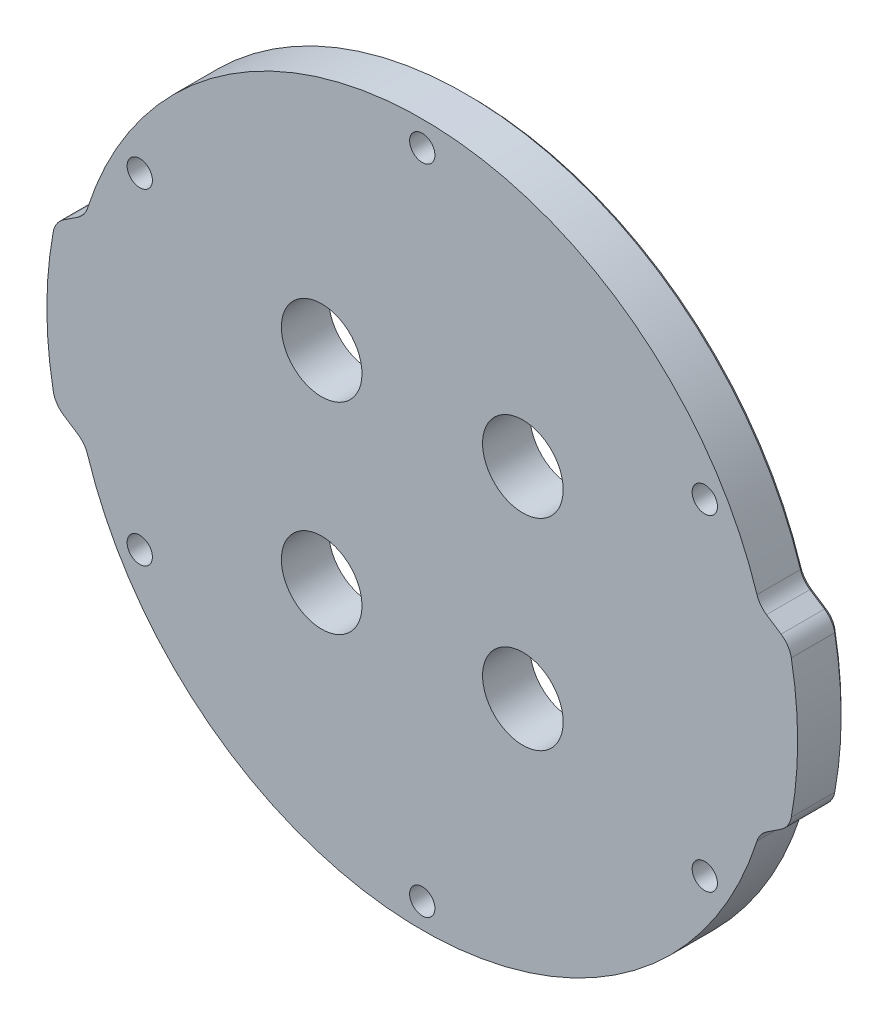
ISO-10303-21;
HEADER;
FILE_DESCRIPTION(('STEP AP214'),'2;1');
FILE_NAME('part.step','',(''),(''),'','','');
FILE_SCHEMA(('AUTOMOTIVE_DESIGN { 1 0 10303 214 1 1 1 1 }'));
ENDSEC;
DATA;
#1=APPLICATION_CONTEXT('core data for automotive mechanical design processes');
#2=APPLICATION_PROTOCOL_DEFINITION('international standard','automotive_design',2000,#1);
#3=PRODUCT_CONTEXT('',#1,'mechanical');
#4=PRODUCT('Part','Part','',(#3));
#5=PRODUCT_RELATED_PRODUCT_CATEGORY('part','',(#4));
#6=PRODUCT_DEFINITION_FORMATION('','',#4);
#7=PRODUCT_DEFINITION_CONTEXT('part definition',#1,'design');
#8=PRODUCT_DEFINITION('design','',#6,#7);
#9=PRODUCT_DEFINITION_SHAPE('','',#8);
#10=(LENGTH_UNIT() NAMED_UNIT(*) SI_UNIT(.MILLI.,.METRE.));
#11=(NAMED_UNIT(*) PLANE_ANGLE_UNIT() SI_UNIT($,.RADIAN.));
#12=(NAMED_UNIT(*) SI_UNIT($,.STERADIAN.) SOLID_ANGLE_UNIT());
#13=UNCERTAINTY_MEASURE_WITH_UNIT(LENGTH_MEASURE(1.E-05),#10,'distance_accuracy_value','');
#14=(GEOMETRIC_REPRESENTATION_CONTEXT(3) GLOBAL_UNCERTAINTY_ASSIGNED_CONTEXT((#13)) GLOBAL_UNIT_ASSIGNED_CONTEXT((#10,
#11,#12)) REPRESENTATION_CONTEXT('',''));
#15=CARTESIAN_POINT('',(0.,0.,0.));
#16=DIRECTION('',(0.,0.,1.));
#17=DIRECTION('',(1.,0.,0.));
#18=AXIS2_PLACEMENT_3D('',#15,#16,#17);
#19=CARTESIAN_POINT('',(0.,0.,6.));
#20=DIRECTION('',(0.,0.,-1.));
#21=DIRECTION('',(-1.,0.,0.));
#22=AXIS2_PLACEMENT_3D('',#19,#20,#21);
#23=PLANE('',#22);
#24=CARTESIAN_POINT('',(-12.7279220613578,12.7279220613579,6.));
#25=DIRECTION('',(0.,0.,1.));
#26=DIRECTION('',(1.,0.,0.));
#27=AXIS2_PLACEMENT_3D('',#24,#25,#26);
#28=CIRCLE('',#27,5.1);
#29=CARTESIAN_POINT('',(-7.62792206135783,12.7279220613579,6.));
#30=VERTEX_POINT('',#29);
#31=EDGE_CURVE('E462',#30,#30,#28,.T.);
#32=ORIENTED_EDGE('',*,*,#31,.F.);
#33=EDGE_LOOP('',(#32));
#34=FACE_BOUND('',#33,.T.);
#35=CARTESIAN_POINT('',(-12.7279220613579,-12.7279220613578,6.));
#36=DIRECTION('',(0.,0.,1.));
#37=DIRECTION('',(1.,0.,0.));
#38=AXIS2_PLACEMENT_3D('',#35,#36,#37);
#39=CIRCLE('',#38,5.1);
#40=CARTESIAN_POINT('',(-7.62792206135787,-12.7279220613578,6.));
#41=VERTEX_POINT('',#40);
#42=EDGE_CURVE('E477',#41,#41,#39,.T.);
#43=ORIENTED_EDGE('',*,*,#42,.F.);
#44=EDGE_LOOP('',(#43));
#45=FACE_BOUND('',#44,.T.);
#46=CARTESIAN_POINT('',(12.7279220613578,-12.7279220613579,6.));
#47=DIRECTION('',(0.,0.,1.));
#48=DIRECTION('',(1.,0.,0.));
#49=AXIS2_PLACEMENT_3D('',#46,#47,#48);
#50=CIRCLE('',#49,5.1);
#51=CARTESIAN_POINT('',(17.8279220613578,-12.7279220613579,6.));
#52=VERTEX_POINT('',#51);
#53=EDGE_CURVE('E484',#52,#52,#50,.T.);
#54=ORIENTED_EDGE('',*,*,#53,.F.);
#55=EDGE_LOOP('',(#54));
#56=FACE_BOUND('',#55,.T.);
#57=CARTESIAN_POINT('',(12.7279220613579,12.7279220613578,6.));
#58=DIRECTION('',(0.,0.,1.));
#59=DIRECTION('',(1.,0.,0.));
#60=AXIS2_PLACEMENT_3D('',#57,#58,#59);
#61=CIRCLE('',#60,5.10000000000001);
#62=CARTESIAN_POINT('',(17.8279220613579,12.7279220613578,6.));
#63=VERTEX_POINT('',#62);
#64=EDGE_CURVE('E491',#63,#63,#61,.T.);
#65=ORIENTED_EDGE('',*,*,#64,.F.);
#66=EDGE_LOOP('',(#65));
#67=FACE_BOUND('',#66,.T.);
#68=DIRECTION('',(0.834029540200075,0.551719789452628,0.));
#69=VECTOR('',#68,1.);
#70=CARTESIAN_POINT('',(46.4354390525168,-10.,6.));
#71=LINE('',#70,#69);
#72=CARTESIAN_POINT('',(43.5545381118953,-11.9057479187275,6.));
#73=VERTEX_POINT('',#72);
#74=CARTESIAN_POINT('',(45.3958207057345,-10.687719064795,6.));
#75=VERTEX_POINT('',#74);
#76=EDGE_CURVE('E212',#73,#75,#71,.T.);
#77=ORIENTED_EDGE('',*,*,#76,.T.);
#78=CARTESIAN_POINT('',(43.7406613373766,-8.18563044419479,6.));
#79=DIRECTION('',(0.,0.,-1.));
#80=DIRECTION('',(-1.,0.,0.));
#81=AXIS2_PLACEMENT_3D('',#78,#79,#80);
#82=CIRCLE('',#81,3.);
#83=CARTESIAN_POINT('',(46.6894699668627,-8.73747069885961,6.));
#84=VERTEX_POINT('',#83);
#85=EDGE_CURVE('E206',#75,#84,#82,.F.);
#86=ORIENTED_EDGE('',*,*,#85,.T.);
#87=CARTESIAN_POINT('',(0.,0.,6.));
#88=DIRECTION('',(0.,0.,1.));
#89=DIRECTION('',(-1.,0.,0.));
#90=AXIS2_PLACEMENT_3D('',#87,#88,#89);
#91=CIRCLE('',#90,47.5);
#92=CARTESIAN_POINT('',(46.6894699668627,8.73747069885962,6.));
#93=VERTEX_POINT('',#92);
#94=EDGE_CURVE('E209',#84,#93,#91,.T.);
#95=ORIENTED_EDGE('',*,*,#94,.T.);
#96=CARTESIAN_POINT('',(43.7406613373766,8.1856304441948,6.));
#97=DIRECTION('',(0.,0.,-1.));
#98=DIRECTION('',(-1.,0.,0.));
#99=AXIS2_PLACEMENT_3D('',#96,#97,#98);
#100=CIRCLE('',#99,3.);
#101=CARTESIAN_POINT('',(45.3958207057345,10.687719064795,6.));
#102=VERTEX_POINT('',#101);
#103=EDGE_CURVE('E218',#93,#102,#100,.F.);
#104=ORIENTED_EDGE('',*,*,#103,.T.);
#105=DIRECTION('',(-0.834029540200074,0.551719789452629,0.));
#106=VECTOR('',#105,1.);
#107=CARTESIAN_POINT('',(46.4354390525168,10.,6.));
#108=LINE('',#107,#106);
#109=CARTESIAN_POINT('',(43.5545381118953,11.9057479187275,6.));
#110=VERTEX_POINT('',#109);
#111=EDGE_CURVE('E228',#102,#110,#108,.T.);
#112=ORIENTED_EDGE('',*,*,#111,.T.);
#113=CARTESIAN_POINT('',(45.2096974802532,14.4078365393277,6.));
#114=DIRECTION('',(0.,0.,-1.));
#115=DIRECTION('',(-1.,0.,0.));
#116=AXIS2_PLACEMENT_3D('',#113,#114,#115);
#117=CIRCLE('',#116,3.);
#118=CARTESIAN_POINT('',(42.3513393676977,13.4969090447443,6.));
#119=VERTEX_POINT('',#118);
#120=EDGE_CURVE('E297',#110,#119,#117,.T.);
#121=ORIENTED_EDGE('',*,*,#120,.T.);
#122=CARTESIAN_POINT('',(0.,0.,6.));
#123=DIRECTION('',(0.,0.,1.));
#124=DIRECTION('',(1.,0.,0.));
#125=AXIS2_PLACEMENT_3D('',#122,#123,#124);
#126=CIRCLE('',#125,44.45);
#127=CARTESIAN_POINT('',(-42.3513393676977,13.4969090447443,6.));
#128=VERTEX_POINT('',#127);
#129=EDGE_CURVE('E551',#119,#128,#126,.T.);
#130=ORIENTED_EDGE('',*,*,#129,.T.);
#131=CARTESIAN_POINT('',(-45.2096974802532,14.4078365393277,6.));
#132=DIRECTION('',(0.,0.,-1.));
#133=DIRECTION('',(-1.,0.,0.));
#134=AXIS2_PLACEMENT_3D('',#131,#132,#133);
#135=CIRCLE('',#134,3.);
#136=CARTESIAN_POINT('',(-43.5545381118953,11.9057479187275,6.));
#137=VERTEX_POINT('',#136);
#138=EDGE_CURVE('E306',#128,#137,#135,.T.);
#139=ORIENTED_EDGE('',*,*,#138,.T.);
#140=DIRECTION('',(-0.834029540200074,-0.551719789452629,0.));
#141=VECTOR('',#140,1.);
#142=CARTESIAN_POINT('',(-46.4354390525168,10.,6.));
#143=LINE('',#142,#141);
#144=CARTESIAN_POINT('',(-45.3958207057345,10.687719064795,6.));
#145=VERTEX_POINT('',#144);
#146=EDGE_CURVE('E555',#137,#145,#143,.T.);
#147=ORIENTED_EDGE('',*,*,#146,.T.);
#148=CARTESIAN_POINT('',(-43.7406613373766,8.1856304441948,6.));
#149=DIRECTION('',(0.,0.,-1.));
#150=DIRECTION('',(-1.,0.,0.));
#151=AXIS2_PLACEMENT_3D('',#148,#149,#150);
#152=CIRCLE('',#151,3.);
#153=CARTESIAN_POINT('',(-46.6894699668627,8.73747069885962,6.));
#154=VERTEX_POINT('',#153);
#155=EDGE_CURVE('E249',#145,#154,#152,.F.);
#156=ORIENTED_EDGE('',*,*,#155,.T.);
#157=CARTESIAN_POINT('',(0.,0.,6.));
#158=DIRECTION('',(0.,0.,1.));
#159=DIRECTION('',(1.,0.,0.));
#160=AXIS2_PLACEMENT_3D('',#157,#158,#159);
#161=CIRCLE('',#160,47.5);
#162=CARTESIAN_POINT('',(-46.6894699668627,-8.73747069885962,6.));
#163=VERTEX_POINT('',#162);
#164=EDGE_CURVE('E559',#154,#163,#161,.T.);
#165=ORIENTED_EDGE('',*,*,#164,.T.);
#166=CARTESIAN_POINT('',(-43.7406613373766,-8.1856304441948,6.));
#167=DIRECTION('',(0.,0.,-1.));
#168=DIRECTION('',(-1.,0.,0.));
#169=AXIS2_PLACEMENT_3D('',#166,#167,#168);
#170=CIRCLE('',#169,3.);
#171=CARTESIAN_POINT('',(-45.3958207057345,-10.687719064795,6.));
#172=VERTEX_POINT('',#171);
#173=EDGE_CURVE('E252',#163,#172,#170,.F.);
#174=ORIENTED_EDGE('',*,*,#173,.T.);
#175=DIRECTION('',(0.834029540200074,-0.551719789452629,0.));
#176=VECTOR('',#175,1.);
#177=CARTESIAN_POINT('',(-46.4354390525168,-10.,6.));
#178=LINE('',#177,#176);
#179=CARTESIAN_POINT('',(-43.5545381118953,-11.9057479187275,6.));
#180=VERTEX_POINT('',#179);
#181=EDGE_CURVE('E563',#172,#180,#178,.T.);
#182=ORIENTED_EDGE('',*,*,#181,.T.);
#183=CARTESIAN_POINT('',(-45.2096974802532,-14.4078365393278,6.));
#184=DIRECTION('',(0.,0.,-1.));
#185=DIRECTION('',(-1.,0.,0.));
#186=AXIS2_PLACEMENT_3D('',#183,#184,#185);
#187=CIRCLE('',#186,3.);
#188=CARTESIAN_POINT('',(-42.3513393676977,-13.4969090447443,6.));
#189=VERTEX_POINT('',#188);
#190=EDGE_CURVE('E303',#180,#189,#187,.T.);
#191=ORIENTED_EDGE('',*,*,#190,.T.);
#192=CARTESIAN_POINT('',(0.,0.,6.));
#193=DIRECTION('',(0.,0.,1.));
#194=DIRECTION('',(1.,0.,0.));
#195=AXIS2_PLACEMENT_3D('',#192,#193,#194);
#196=CIRCLE('',#195,44.45);
#197=CARTESIAN_POINT('',(42.3513393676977,-13.4969090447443,6.));
#198=VERTEX_POINT('',#197);
#199=EDGE_CURVE('E566',#189,#198,#196,.T.);
#200=ORIENTED_EDGE('',*,*,#199,.T.);
#201=CARTESIAN_POINT('',(45.2096974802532,-14.4078365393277,6.));
#202=DIRECTION('',(0.,0.,-1.));
#203=DIRECTION('',(-1.,0.,0.));
#204=AXIS2_PLACEMENT_3D('',#201,#202,#203);
#205=CIRCLE('',#204,3.);
#206=EDGE_CURVE('E300',#198,#73,#205,.T.);
#207=ORIENTED_EDGE('',*,*,#206,.T.);
#208=EDGE_LOOP('',(#77,#86,#95,#104,#112,#121,#130,#139,#147,#156,#165,#174,#182,#191,#200,#207));
#209=FACE_BOUND('',#208,.T.);
#210=CARTESIAN_POINT('',(0.,41.275,6.));
#211=DIRECTION('',(0.,0.,1.));
#212=DIRECTION('',(1.,0.,0.));
#213=AXIS2_PLACEMENT_3D('',#210,#211,#212);
#214=CIRCLE('',#213,1.6);
#215=CARTESIAN_POINT('',(1.6,41.275,6.));
#216=VERTEX_POINT('',#215);
#217=EDGE_CURVE('E229',#216,#216,#214,.T.);
#218=ORIENTED_EDGE('',*,*,#217,.F.);
#219=EDGE_LOOP('',(#218));
#220=FACE_BOUND('',#219,.T.);
#221=CARTESIAN_POINT('',(-35.7451985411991,-20.6375000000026,6.));
#222=DIRECTION('',(0.,0.,1.));
#223=DIRECTION('',(1.,0.,0.));
#224=AXIS2_PLACEMENT_3D('',#221,#222,#223);
#225=CIRCLE('',#224,1.6);
#226=CARTESIAN_POINT('',(-34.1451985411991,-20.6375000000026,6.));
#227=VERTEX_POINT('',#226);
#228=EDGE_CURVE('E534',#227,#227,#225,.T.);
#229=ORIENTED_EDGE('',*,*,#228,.F.);
#230=EDGE_LOOP('',(#229));
#231=FACE_BOUND('',#230,.T.);
#232=CARTESIAN_POINT('',(35.7451985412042,20.6375000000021,6.));
#233=DIRECTION('',(0.,0.,1.));
#234=DIRECTION('',(1.,0.,0.));
#235=AXIS2_PLACEMENT_3D('',#232,#233,#234);
#236=CIRCLE('',#235,1.59999999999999);
#237=CARTESIAN_POINT('',(37.3451985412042,20.6375000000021,6.));
#238=VERTEX_POINT('',#237);
#239=EDGE_CURVE('E526',#238,#238,#236,.T.);
#240=ORIENTED_EDGE('',*,*,#239,.F.);
#241=EDGE_LOOP('',(#240));
#242=FACE_BOUND('',#241,.T.);
#243=CARTESIAN_POINT('',(35.7451985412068,-20.6374999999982,6.));
#244=DIRECTION('',(0.,0.,1.));
#245=DIRECTION('',(1.,0.,0.));
#246=AXIS2_PLACEMENT_3D('',#243,#244,#245);
#247=CIRCLE('',#246,1.6);
#248=CARTESIAN_POINT('',(37.3451985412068,-20.6374999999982,6.));
#249=VERTEX_POINT('',#248);
#250=EDGE_CURVE('E518',#249,#249,#247,.T.);
#251=ORIENTED_EDGE('',*,*,#250,.F.);
#252=EDGE_LOOP('',(#251));
#253=FACE_BOUND('',#252,.T.);
#254=CARTESIAN_POINT('',(5.11138805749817E-12,-41.2750000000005,6.));
#255=DIRECTION('',(0.,0.,1.));
#256=DIRECTION('',(1.,0.,0.));
#257=AXIS2_PLACEMENT_3D('',#254,#255,#256);
#258=CIRCLE('',#257,1.6);
#259=CARTESIAN_POINT('',(1.60000000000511,-41.2750000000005,6.));
#260=VERTEX_POINT('',#259);
#261=EDGE_CURVE('E510',#260,#260,#258,.T.);
#262=ORIENTED_EDGE('',*,*,#261,.F.);
#263=EDGE_LOOP('',(#262));
#264=FACE_BOUND('',#263,.T.);
#265=CARTESIAN_POINT('',(-35.7451985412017,20.6374999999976,6.));
#266=DIRECTION('',(0.,0.,1.));
#267=DIRECTION('',(1.,0.,0.));
#268=AXIS2_PLACEMENT_3D('',#265,#266,#267);
#269=CIRCLE('',#268,1.6);
#270=CARTESIAN_POINT('',(-34.1451985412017,20.6374999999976,6.));
#271=VERTEX_POINT('',#270);
#272=EDGE_CURVE('E503',#271,#271,#269,.T.);
#273=ORIENTED_EDGE('',*,*,#272,.F.);
#274=EDGE_LOOP('',(#273));
#275=FACE_BOUND('',#274,.T.);
#276=ADVANCED_FACE('F41',(#34,#45,#56,#67,#209,#220,#231,#242,#253,#264,#275),#23,.F.);
#277=CARTESIAN_POINT('',(0.,0.,0.));
#278=DIRECTION('',(0.,0.,-1.));
#279=DIRECTION('',(-1.,0.,0.));
#280=AXIS2_PLACEMENT_3D('',#277,#278,#279);
#281=PLANE('',#280);
#282=CARTESIAN_POINT('',(45.2096974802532,-14.4078365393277,0.));
#283=DIRECTION('',(0.,0.,-1.));
#284=DIRECTION('',(-1.,0.,0.));
#285=AXIS2_PLACEMENT_3D('',#282,#283,#284);
#286=CIRCLE('',#285,3.5);
#287=CARTESIAN_POINT('',(43.278678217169,-11.4887331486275,0.));
#288=VERTEX_POINT('',#287);
#289=CARTESIAN_POINT('',(41.8749463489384,-13.3450877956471,0.));
#290=VERTEX_POINT('',#289);
#291=EDGE_CURVE('E354',#288,#290,#286,.F.);
#292=ORIENTED_EDGE('',*,*,#291,.T.);
#293=CARTESIAN_POINT('',(0.,0.,0.));
#294=DIRECTION('',(0.,0.,-1.));
#295=DIRECTION('',(-1.,0.,0.));
#296=AXIS2_PLACEMENT_3D('',#293,#294,#295);
#297=CIRCLE('',#296,43.95);
#298=CARTESIAN_POINT('',(-41.8749463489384,-13.3450877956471,0.));
#299=VERTEX_POINT('',#298);
#300=EDGE_CURVE('E357',#290,#299,#297,.T.);
#301=ORIENTED_EDGE('',*,*,#300,.T.);
#302=CARTESIAN_POINT('',(-45.2096974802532,-14.4078365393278,0.));
#303=DIRECTION('',(0.,0.,-1.));
#304=DIRECTION('',(-1.,0.,0.));
#305=AXIS2_PLACEMENT_3D('',#302,#303,#304);
#306=CIRCLE('',#305,3.5);
#307=CARTESIAN_POINT('',(-43.278678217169,-11.4887331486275,0.));
#308=VERTEX_POINT('',#307);
#309=EDGE_CURVE('E351',#299,#308,#306,.F.);
#310=ORIENTED_EDGE('',*,*,#309,.T.);
#311=DIRECTION('',(-0.834029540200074,0.551719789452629,0.));
#312=VECTOR('',#311,1.);
#313=CARTESIAN_POINT('',(-45.1199608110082,-10.270704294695,0.));
#314=LINE('',#313,#312);
#315=CARTESIAN_POINT('',(-45.1199608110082,-10.270704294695,0.));
#316=VERTEX_POINT('',#315);
#317=EDGE_CURVE('E345',#308,#316,#314,.T.);
#318=ORIENTED_EDGE('',*,*,#317,.T.);
#319=CARTESIAN_POINT('',(-43.7406613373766,-8.1856304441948,0.));
#320=DIRECTION('',(0.,0.,-1.));
#321=DIRECTION('',(-1.,0.,0.));
#322=AXIS2_PLACEMENT_3D('',#319,#320,#321);
#323=CIRCLE('',#322,2.5);
#324=CARTESIAN_POINT('',(-46.1980018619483,-8.64549732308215,0.));
#325=VERTEX_POINT('',#324);
#326=EDGE_CURVE('E339',#316,#325,#323,.T.);
#327=ORIENTED_EDGE('',*,*,#326,.T.);
#328=CARTESIAN_POINT('',(0.,0.,0.));
#329=DIRECTION('',(0.,0.,-1.));
#330=DIRECTION('',(-1.,0.,0.));
#331=AXIS2_PLACEMENT_3D('',#328,#329,#330);
#332=CIRCLE('',#331,47.);
#333=CARTESIAN_POINT('',(-46.1980018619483,8.64549732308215,0.));
#334=VERTEX_POINT('',#333);
#335=EDGE_CURVE('E333',#325,#334,#332,.T.);
#336=ORIENTED_EDGE('',*,*,#335,.T.);
#337=CARTESIAN_POINT('',(-43.7406613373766,8.1856304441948,0.));
#338=DIRECTION('',(0.,0.,-1.));
#339=DIRECTION('',(-1.,0.,0.));
#340=AXIS2_PLACEMENT_3D('',#337,#338,#339);
#341=CIRCLE('',#340,2.5);
#342=CARTESIAN_POINT('',(-45.1199608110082,10.270704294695,0.));
#343=VERTEX_POINT('',#342);
#344=EDGE_CURVE('E327',#334,#343,#341,.T.);
#345=ORIENTED_EDGE('',*,*,#344,.T.);
#346=DIRECTION('',(0.834029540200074,0.551719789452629,0.));
#347=VECTOR('',#346,1.);
#348=CARTESIAN_POINT('',(-43.278678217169,11.4887331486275,0.));
#349=LINE('',#348,#347);
#350=CARTESIAN_POINT('',(-43.278678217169,11.4887331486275,0.));
#351=VERTEX_POINT('',#350);
#352=EDGE_CURVE('E321',#343,#351,#349,.T.);
#353=ORIENTED_EDGE('',*,*,#352,.T.);
#354=CARTESIAN_POINT('',(-45.2096974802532,14.4078365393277,0.));
#355=DIRECTION('',(0.,0.,-1.));
#356=DIRECTION('',(-1.,0.,0.));
#357=AXIS2_PLACEMENT_3D('',#354,#355,#356);
#358=CIRCLE('',#357,3.5);
#359=CARTESIAN_POINT('',(-41.8749463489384,13.3450877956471,0.));
#360=VERTEX_POINT('',#359);
#361=EDGE_CURVE('E315',#351,#360,#358,.F.);
#362=ORIENTED_EDGE('',*,*,#361,.T.);
#363=CARTESIAN_POINT('',(0.,0.,0.));
#364=DIRECTION('',(0.,0.,-1.));
#365=DIRECTION('',(-1.,0.,0.));
#366=AXIS2_PLACEMENT_3D('',#363,#364,#365);
#367=CIRCLE('',#366,43.95);
#368=CARTESIAN_POINT('',(41.8749463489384,13.3450877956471,0.));
#369=VERTEX_POINT('',#368);
#370=EDGE_CURVE('E312',#360,#369,#367,.T.);
#371=ORIENTED_EDGE('',*,*,#370,.T.);
#372=CARTESIAN_POINT('',(45.2096974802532,14.4078365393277,0.));
#373=DIRECTION('',(0.,0.,-1.));
#374=DIRECTION('',(-1.,0.,0.));
#375=AXIS2_PLACEMENT_3D('',#372,#373,#374);
#376=CIRCLE('',#375,3.5);
#377=CARTESIAN_POINT('',(43.278678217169,11.4887331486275,0.));
#378=VERTEX_POINT('',#377);
#379=EDGE_CURVE('E318',#369,#378,#376,.F.);
#380=ORIENTED_EDGE('',*,*,#379,.T.);
#381=DIRECTION('',(0.834029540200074,-0.551719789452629,0.));
#382=VECTOR('',#381,1.);
#383=CARTESIAN_POINT('',(45.1199608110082,10.270704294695,0.));
#384=LINE('',#383,#382);
#385=CARTESIAN_POINT('',(45.1199608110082,10.270704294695,0.));
#386=VERTEX_POINT('',#385);
#387=EDGE_CURVE('E324',#378,#386,#384,.T.);
#388=ORIENTED_EDGE('',*,*,#387,.T.);
#389=CARTESIAN_POINT('',(43.7406613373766,8.1856304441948,0.));
#390=DIRECTION('',(0.,0.,-1.));
#391=DIRECTION('',(-1.,0.,0.));
#392=AXIS2_PLACEMENT_3D('',#389,#390,#391);
#393=CIRCLE('',#392,2.5);
#394=CARTESIAN_POINT('',(46.1980018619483,8.64549732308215,0.));
#395=VERTEX_POINT('',#394);
#396=EDGE_CURVE('E330',#386,#395,#393,.T.);
#397=ORIENTED_EDGE('',*,*,#396,.T.);
#398=CARTESIAN_POINT('',(0.,0.,0.));
#399=DIRECTION('',(0.,0.,-1.));
#400=DIRECTION('',(-1.,0.,0.));
#401=AXIS2_PLACEMENT_3D('',#398,#399,#400);
#402=CIRCLE('',#401,47.);
#403=CARTESIAN_POINT('',(46.1980018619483,-8.64549732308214,0.));
#404=VERTEX_POINT('',#403);
#405=EDGE_CURVE('E336',#395,#404,#402,.T.);
#406=ORIENTED_EDGE('',*,*,#405,.T.);
#407=CARTESIAN_POINT('',(43.7406613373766,-8.18563044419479,0.));
#408=DIRECTION('',(0.,0.,-1.));
#409=DIRECTION('',(-1.,0.,0.));
#410=AXIS2_PLACEMENT_3D('',#407,#408,#409);
#411=CIRCLE('',#410,2.5);
#412=CARTESIAN_POINT('',(45.1199608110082,-10.270704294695,0.));
#413=VERTEX_POINT('',#412);
#414=EDGE_CURVE('E342',#404,#413,#411,.T.);
#415=ORIENTED_EDGE('',*,*,#414,.T.);
#416=DIRECTION('',(-0.834029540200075,-0.551719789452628,0.));
#417=VECTOR('',#416,1.);
#418=CARTESIAN_POINT('',(43.278678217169,-11.4887331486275,0.));
#419=LINE('',#418,#417);
#420=EDGE_CURVE('E348',#413,#288,#419,.T.);
#421=ORIENTED_EDGE('',*,*,#420,.T.);
#422=EDGE_LOOP('',(#292,#301,#310,#318,#327,#336,#345,#353,#362,#371,#380,#388,#397,#406,#415,#421));
#423=FACE_BOUND('',#422,.T.);
#424=CARTESIAN_POINT('',(-12.7279220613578,12.7279220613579,0.));
#425=DIRECTION('',(0.,0.,1.));
#426=DIRECTION('',(1.,0.,0.));
#427=AXIS2_PLACEMENT_3D('',#424,#425,#426);
#428=CIRCLE('',#427,5.1);
#429=CARTESIAN_POINT('',(-7.62792206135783,12.7279220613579,0.));
#430=VERTEX_POINT('',#429);
#431=EDGE_CURVE('E470',#430,#430,#428,.T.);
#432=ORIENTED_EDGE('',*,*,#431,.T.);
#433=EDGE_LOOP('',(#432));
#434=FACE_BOUND('',#433,.T.);
#435=CARTESIAN_POINT('',(-12.7279220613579,-12.7279220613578,0.));
#436=DIRECTION('',(0.,0.,1.));
#437=DIRECTION('',(1.,0.,0.));
#438=AXIS2_PLACEMENT_3D('',#435,#436,#437);
#439=CIRCLE('',#438,5.1);
#440=CARTESIAN_POINT('',(-7.62792206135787,-12.7279220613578,0.));
#441=VERTEX_POINT('',#440);
#442=EDGE_CURVE('E480',#441,#441,#439,.T.);
#443=ORIENTED_EDGE('',*,*,#442,.T.);
#444=EDGE_LOOP('',(#443));
#445=FACE_BOUND('',#444,.T.);
#446=CARTESIAN_POINT('',(12.7279220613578,-12.7279220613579,0.));
#447=DIRECTION('',(0.,0.,1.));
#448=DIRECTION('',(1.,0.,0.));
#449=AXIS2_PLACEMENT_3D('',#446,#447,#448);
#450=CIRCLE('',#449,5.1);
#451=CARTESIAN_POINT('',(17.8279220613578,-12.7279220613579,0.));
#452=VERTEX_POINT('',#451);
#453=EDGE_CURVE('E488',#452,#452,#450,.T.);
#454=ORIENTED_EDGE('',*,*,#453,.T.);
#455=EDGE_LOOP('',(#454));
#456=FACE_BOUND('',#455,.T.);
#457=CARTESIAN_POINT('',(12.7279220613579,12.7279220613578,0.));
#458=DIRECTION('',(0.,0.,1.));
#459=DIRECTION('',(1.,0.,0.));
#460=AXIS2_PLACEMENT_3D('',#457,#458,#459);
#461=CIRCLE('',#460,5.10000000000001);
#462=CARTESIAN_POINT('',(17.8279220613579,12.7279220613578,0.));
#463=VERTEX_POINT('',#462);
#464=EDGE_CURVE('E495',#463,#463,#461,.T.);
#465=ORIENTED_EDGE('',*,*,#464,.T.);
#466=EDGE_LOOP('',(#465));
#467=FACE_BOUND('',#466,.T.);
#468=CARTESIAN_POINT('',(5.11138805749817E-12,-41.2750000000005,0.));
#469=DIRECTION('',(0.,0.,1.));
#470=DIRECTION('',(1.,0.,0.));
#471=AXIS2_PLACEMENT_3D('',#468,#469,#470);
#472=CIRCLE('',#471,1.6);
#473=CARTESIAN_POINT('',(1.60000000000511,-41.2750000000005,0.));
#474=VERTEX_POINT('',#473);
#475=EDGE_CURVE('E507',#474,#474,#472,.T.);
#476=ORIENTED_EDGE('',*,*,#475,.T.);
#477=EDGE_LOOP('',(#476));
#478=FACE_BOUND('',#477,.T.);
#479=CARTESIAN_POINT('',(35.7451985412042,20.6375000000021,0.));
#480=DIRECTION('',(0.,0.,1.));
#481=DIRECTION('',(1.,0.,0.));
#482=AXIS2_PLACEMENT_3D('',#479,#480,#481);
#483=CIRCLE('',#482,1.59999999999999);
#484=CARTESIAN_POINT('',(37.3451985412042,20.6375000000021,0.));
#485=VERTEX_POINT('',#484);
#486=EDGE_CURVE('E522',#485,#485,#483,.T.);
#487=ORIENTED_EDGE('',*,*,#486,.T.);
#488=EDGE_LOOP('',(#487));
#489=FACE_BOUND('',#488,.T.);
#490=CARTESIAN_POINT('',(0.,41.275,0.));
#491=DIRECTION('',(0.,0.,1.));
#492=DIRECTION('',(1.,0.,0.));
#493=AXIS2_PLACEMENT_3D('',#490,#491,#492);
#494=CIRCLE('',#493,1.6);
#495=CARTESIAN_POINT('',(1.6,41.275,0.));
#496=VERTEX_POINT('',#495);
#497=EDGE_CURVE('E538',#496,#496,#494,.T.);
#498=ORIENTED_EDGE('',*,*,#497,.T.);
#499=EDGE_LOOP('',(#498));
#500=FACE_BOUND('',#499,.T.);
#501=CARTESIAN_POINT('',(-35.7451985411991,-20.6375000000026,0.));
#502=DIRECTION('',(0.,0.,1.));
#503=DIRECTION('',(1.,0.,0.));
#504=AXIS2_PLACEMENT_3D('',#501,#502,#503);
#505=CIRCLE('',#504,1.6);
#506=CARTESIAN_POINT('',(-34.1451985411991,-20.6375000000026,0.));
#507=VERTEX_POINT('',#506);
#508=EDGE_CURVE('E530',#507,#507,#505,.T.);
#509=ORIENTED_EDGE('',*,*,#508,.T.);
#510=EDGE_LOOP('',(#509));
#511=FACE_BOUND('',#510,.T.);
#512=CARTESIAN_POINT('',(35.7451985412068,-20.6374999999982,0.));
#513=DIRECTION('',(0.,0.,1.));
#514=DIRECTION('',(1.,0.,0.));
#515=AXIS2_PLACEMENT_3D('',#512,#513,#514);
#516=CIRCLE('',#515,1.6);
#517=CARTESIAN_POINT('',(37.3451985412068,-20.6374999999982,0.));
#518=VERTEX_POINT('',#517);
#519=EDGE_CURVE('E514',#518,#518,#516,.T.);
#520=ORIENTED_EDGE('',*,*,#519,.T.);
#521=EDGE_LOOP('',(#520));
#522=FACE_BOUND('',#521,.T.);
#523=CARTESIAN_POINT('',(-35.7451985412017,20.6374999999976,0.));
#524=DIRECTION('',(0.,0.,1.));
#525=DIRECTION('',(1.,0.,0.));
#526=AXIS2_PLACEMENT_3D('',#523,#524,#525);
#527=CIRCLE('',#526,1.6);
#528=CARTESIAN_POINT('',(-34.1451985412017,20.6374999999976,0.));
#529=VERTEX_POINT('',#528);
#530=EDGE_CURVE('E499',#529,#529,#527,.T.);
#531=ORIENTED_EDGE('',*,*,#530,.T.);
#532=EDGE_LOOP('',(#531));
#533=FACE_BOUND('',#532,.T.);
#534=ADVANCED_FACE('F593',(#423,#434,#445,#456,#467,#478,#489,#500,#511,#522,#533),#281,.T.);
#535=CARTESIAN_POINT('',(0.,0.,6.));
#536=DIRECTION('',(0.,0.,-1.));
#537=DIRECTION('',(-1.,0.,0.));
#538=AXIS2_PLACEMENT_3D('',#535,#536,#537);
#539=CYLINDRICAL_SURFACE('',#538,47.5);
#540=DIRECTION('',(0.,0.,-1.));
#541=VECTOR('',#540,1.);
#542=CARTESIAN_POINT('',(46.6894699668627,-8.73747069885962,6.));
#543=LINE('',#542,#541);
#544=CARTESIAN_POINT('',(46.6894699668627,-8.73747069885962,0.5));
#545=VERTEX_POINT('',#544);
#546=EDGE_CURVE('E223',#84,#545,#543,.T.);
#547=ORIENTED_EDGE('',*,*,#546,.T.);
#548=CARTESIAN_POINT('',(0.,0.,0.5));
#549=DIRECTION('',(0.,0.,-1.));
#550=DIRECTION('',(-1.,0.,0.));
#551=AXIS2_PLACEMENT_3D('',#548,#549,#550);
#552=CIRCLE('',#551,47.5);
#553=CARTESIAN_POINT('',(46.6894699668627,8.73747069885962,0.5));
#554=VERTEX_POINT('',#553);
#555=EDGE_CURVE('E378',#545,#554,#552,.F.);
#556=ORIENTED_EDGE('',*,*,#555,.T.);
#557=DIRECTION('',(0.,0.,-1.));
#558=VECTOR('',#557,1.);
#559=CARTESIAN_POINT('',(46.6894699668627,8.73747069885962,6.));
#560=LINE('',#559,#558);
#561=EDGE_CURVE('E226',#554,#93,#560,.F.);
#562=ORIENTED_EDGE('',*,*,#561,.T.);
#563=ORIENTED_EDGE('',*,*,#94,.F.);
#564=EDGE_LOOP('',(#547,#556,#562,#563));
#565=FACE_BOUND('',#564,.T.);
#566=ADVANCED_FACE('F222',(#565),#539,.T.);
#567=CARTESIAN_POINT('',(46.4354390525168,10.,6.));
#568=DIRECTION('',(-0.551719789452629,-0.834029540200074,0.));
#569=DIRECTION('',(0.834029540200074,-0.551719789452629,0.));
#570=AXIS2_PLACEMENT_3D('',#567,#568,#569);
#571=PLANE('',#570);
#572=DIRECTION('',(0.,0.,-1.));
#573=VECTOR('',#572,1.);
#574=CARTESIAN_POINT('',(45.3958207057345,10.687719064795,6.));
#575=LINE('',#574,#573);
#576=CARTESIAN_POINT('',(45.3958207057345,10.687719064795,0.5));
#577=VERTEX_POINT('',#576);
#578=EDGE_CURVE('E259',#102,#577,#575,.T.);
#579=ORIENTED_EDGE('',*,*,#578,.T.);
#580=DIRECTION('',(-0.834029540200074,0.551719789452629,0.));
#581=VECTOR('',#580,1.);
#582=CARTESIAN_POINT('',(43.5545381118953,11.9057479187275,0.500000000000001));
#583=LINE('',#582,#581);
#584=CARTESIAN_POINT('',(43.5545381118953,11.9057479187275,0.5));
#585=VERTEX_POINT('',#584);
#586=EDGE_CURVE('E390',#577,#585,#583,.T.);
#587=ORIENTED_EDGE('',*,*,#586,.T.);
#588=DIRECTION('',(0.,0.,1.));
#589=VECTOR('',#588,1.);
#590=CARTESIAN_POINT('',(43.5545381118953,11.9057479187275,6.));
#591=LINE('',#590,#589);
#592=EDGE_CURVE('E217',#585,#110,#591,.T.);
#593=ORIENTED_EDGE('',*,*,#592,.T.);
#594=ORIENTED_EDGE('',*,*,#111,.F.);
#595=EDGE_LOOP('',(#579,#587,#593,#594));
#596=FACE_BOUND('',#595,.T.);
#597=ADVANCED_FACE('F691',(#596),#571,.F.);
#598=CARTESIAN_POINT('',(0.,0.,6.));
#599=DIRECTION('',(0.,0.,-1.));
#600=DIRECTION('',(-1.,0.,0.));
#601=AXIS2_PLACEMENT_3D('',#598,#599,#600);
#602=CYLINDRICAL_SURFACE('',#601,44.45);
#603=DIRECTION('',(0.,0.,-1.));
#604=VECTOR('',#603,1.);
#605=CARTESIAN_POINT('',(42.3513393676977,13.4969090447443,6.));
#606=LINE('',#605,#604);
#607=CARTESIAN_POINT('',(42.3513393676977,13.4969090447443,0.5));
#608=VERTEX_POINT('',#607);
#609=EDGE_CURVE('E266',#119,#608,#606,.T.);
#610=ORIENTED_EDGE('',*,*,#609,.T.);
#611=CARTESIAN_POINT('',(0.,0.,0.5));
#612=DIRECTION('',(0.,0.,-1.));
#613=DIRECTION('',(-1.,0.,0.));
#614=AXIS2_PLACEMENT_3D('',#611,#612,#613);
#615=CIRCLE('',#614,44.45);
#616=CARTESIAN_POINT('',(-42.3513393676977,13.4969090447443,0.5));
#617=VERTEX_POINT('',#616);
#618=EDGE_CURVE('E11',#608,#617,#615,.F.);
#619=ORIENTED_EDGE('',*,*,#618,.T.);
#620=DIRECTION('',(0.,0.,-1.));
#621=VECTOR('',#620,1.);
#622=CARTESIAN_POINT('',(-42.3513393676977,13.4969090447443,6.));
#623=LINE('',#622,#621);
#624=EDGE_CURVE('E263',#617,#128,#623,.F.);
#625=ORIENTED_EDGE('',*,*,#624,.T.);
#626=ORIENTED_EDGE('',*,*,#129,.F.);
#627=EDGE_LOOP('',(#610,#619,#625,#626));
#628=FACE_BOUND('',#627,.T.);
#629=ADVANCED_FACE('F687',(#628),#602,.T.);
#630=CARTESIAN_POINT('',(-46.4354390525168,10.,6.));
#631=DIRECTION('',(0.551719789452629,-0.834029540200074,0.));
#632=DIRECTION('',(0.834029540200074,0.551719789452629,0.));
#633=AXIS2_PLACEMENT_3D('',#630,#631,#632);
#634=PLANE('',#633);
#635=DIRECTION('',(0.,0.,1.));
#636=VECTOR('',#635,1.);
#637=CARTESIAN_POINT('',(-43.5545381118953,11.9057479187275,0.));
#638=LINE('',#637,#636);
#639=CARTESIAN_POINT('',(-43.5545381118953,11.9057479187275,0.5));
#640=VERTEX_POINT('',#639);
#641=EDGE_CURVE('E293',#137,#640,#638,.F.);
#642=ORIENTED_EDGE('',*,*,#641,.T.);
#643=DIRECTION('',(-0.834029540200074,-0.551719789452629,0.));
#644=VECTOR('',#643,1.);
#645=CARTESIAN_POINT('',(-45.3958207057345,10.687719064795,0.500000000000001));
#646=LINE('',#645,#644);
#647=CARTESIAN_POINT('',(-45.3958207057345,10.687719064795,0.5));
#648=VERTEX_POINT('',#647);
#649=EDGE_CURVE('E393',#640,#648,#646,.T.);
#650=ORIENTED_EDGE('',*,*,#649,.T.);
#651=DIRECTION('',(0.,0.,-1.));
#652=VECTOR('',#651,1.);
#653=CARTESIAN_POINT('',(-45.3958207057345,10.687719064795,6.));
#654=LINE('',#653,#652);
#655=EDGE_CURVE('E290',#648,#145,#654,.F.);
#656=ORIENTED_EDGE('',*,*,#655,.T.);
#657=ORIENTED_EDGE('',*,*,#146,.F.);
#658=EDGE_LOOP('',(#642,#650,#656,#657));
#659=FACE_BOUND('',#658,.T.);
#660=ADVANCED_FACE('F683',(#659),#634,.F.);
#661=CARTESIAN_POINT('',(0.,0.,6.));
#662=DIRECTION('',(0.,0.,-1.));
#663=DIRECTION('',(-1.,0.,0.));
#664=AXIS2_PLACEMENT_3D('',#661,#662,#663);
#665=CYLINDRICAL_SURFACE('',#664,47.5);
#666=DIRECTION('',(0.,0.,-1.));
#667=VECTOR('',#666,1.);
#668=CARTESIAN_POINT('',(-46.6894699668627,8.73747069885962,6.));
#669=LINE('',#668,#667);
#670=CARTESIAN_POINT('',(-46.6894699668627,8.73747069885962,0.5));
#671=VERTEX_POINT('',#670);
#672=EDGE_CURVE('E283',#154,#671,#669,.T.);
#673=ORIENTED_EDGE('',*,*,#672,.T.);
#674=CARTESIAN_POINT('',(0.,0.,0.5));
#675=DIRECTION('',(0.,0.,-1.));
#676=DIRECTION('',(-1.,0.,0.));
#677=AXIS2_PLACEMENT_3D('',#674,#675,#676);
#678=CIRCLE('',#677,47.5);
#679=CARTESIAN_POINT('',(-46.6894699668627,-8.73747069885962,0.5));
#680=VERTEX_POINT('',#679);
#681=EDGE_CURVE('E381',#671,#680,#678,.F.);
#682=ORIENTED_EDGE('',*,*,#681,.T.);
#683=DIRECTION('',(0.,0.,-1.));
#684=VECTOR('',#683,1.);
#685=CARTESIAN_POINT('',(-46.6894699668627,-8.73747069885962,6.));
#686=LINE('',#685,#684);
#687=EDGE_CURVE('E287',#680,#163,#686,.F.);
#688=ORIENTED_EDGE('',*,*,#687,.T.);
#689=ORIENTED_EDGE('',*,*,#164,.F.);
#690=EDGE_LOOP('',(#673,#682,#688,#689));
#691=FACE_BOUND('',#690,.T.);
#692=ADVANCED_FACE('F679',(#691),#665,.T.);
#693=CARTESIAN_POINT('',(-46.4354390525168,-10.,6.));
#694=DIRECTION('',(0.551719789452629,0.834029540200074,0.));
#695=DIRECTION('',(-0.834029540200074,0.551719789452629,0.));
#696=AXIS2_PLACEMENT_3D('',#693,#694,#695);
#697=PLANE('',#696);
#698=DIRECTION('',(0.,0.,-1.));
#699=VECTOR('',#698,1.);
#700=CARTESIAN_POINT('',(-45.3958207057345,-10.687719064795,6.));
#701=LINE('',#700,#699);
#702=CARTESIAN_POINT('',(-45.3958207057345,-10.687719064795,0.5));
#703=VERTEX_POINT('',#702);
#704=EDGE_CURVE('E276',#172,#703,#701,.T.);
#705=ORIENTED_EDGE('',*,*,#704,.T.);
#706=DIRECTION('',(0.834029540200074,-0.551719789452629,0.));
#707=VECTOR('',#706,1.);
#708=CARTESIAN_POINT('',(-43.5545381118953,-11.9057479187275,0.500000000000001));
#709=LINE('',#708,#707);
#710=CARTESIAN_POINT('',(-43.5545381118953,-11.9057479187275,0.5));
#711=VERTEX_POINT('',#710);
#712=EDGE_CURVE('E370',#703,#711,#709,.T.);
#713=ORIENTED_EDGE('',*,*,#712,.T.);
#714=DIRECTION('',(0.,0.,1.));
#715=VECTOR('',#714,1.);
#716=CARTESIAN_POINT('',(-43.5545381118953,-11.9057479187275,6.));
#717=LINE('',#716,#715);
#718=EDGE_CURVE('E280',#711,#180,#717,.T.);
#719=ORIENTED_EDGE('',*,*,#718,.T.);
#720=ORIENTED_EDGE('',*,*,#181,.F.);
#721=EDGE_LOOP('',(#705,#713,#719,#720));
#722=FACE_BOUND('',#721,.T.);
#723=ADVANCED_FACE('F676',(#722),#697,.F.);
#724=CARTESIAN_POINT('',(0.,0.,6.));
#725=DIRECTION('',(0.,0.,-1.));
#726=DIRECTION('',(-1.,0.,0.));
#727=AXIS2_PLACEMENT_3D('',#724,#725,#726);
#728=CYLINDRICAL_SURFACE('',#727,44.45);
#729=DIRECTION('',(0.,0.,-1.));
#730=VECTOR('',#729,1.);
#731=CARTESIAN_POINT('',(-42.3513393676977,-13.4969090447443,6.));
#732=LINE('',#731,#730);
#733=CARTESIAN_POINT('',(-42.3513393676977,-13.4969090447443,0.5));
#734=VERTEX_POINT('',#733);
#735=EDGE_CURVE('E269',#189,#734,#732,.T.);
#736=ORIENTED_EDGE('',*,*,#735,.T.);
#737=CARTESIAN_POINT('',(0.,0.,0.5));
#738=DIRECTION('',(0.,0.,-1.));
#739=DIRECTION('',(-1.,0.,0.));
#740=AXIS2_PLACEMENT_3D('',#737,#738,#739);
#741=CIRCLE('',#740,44.45);
#742=CARTESIAN_POINT('',(42.3513393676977,-13.4969090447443,0.5));
#743=VERTEX_POINT('',#742);
#744=EDGE_CURVE('E309',#734,#743,#741,.F.);
#745=ORIENTED_EDGE('',*,*,#744,.T.);
#746=DIRECTION('',(0.,0.,-1.));
#747=VECTOR('',#746,1.);
#748=CARTESIAN_POINT('',(42.3513393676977,-13.4969090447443,6.));
#749=LINE('',#748,#747);
#750=EDGE_CURVE('E273',#743,#198,#749,.F.);
#751=ORIENTED_EDGE('',*,*,#750,.T.);
#752=ORIENTED_EDGE('',*,*,#199,.F.);
#753=EDGE_LOOP('',(#736,#745,#751,#752));
#754=FACE_BOUND('',#753,.T.);
#755=ADVANCED_FACE('F673',(#754),#728,.T.);
#756=CARTESIAN_POINT('',(46.4354390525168,-10.,6.));
#757=DIRECTION('',(-0.551719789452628,0.834029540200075,0.));
#758=DIRECTION('',(-0.834029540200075,-0.551719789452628,0.));
#759=AXIS2_PLACEMENT_3D('',#756,#757,#758);
#760=PLANE('',#759);
#761=DIRECTION('',(0.,0.,1.));
#762=VECTOR('',#761,1.);
#763=CARTESIAN_POINT('',(43.5545381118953,-11.9057479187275,0.));
#764=LINE('',#763,#762);
#765=CARTESIAN_POINT('',(43.5545381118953,-11.9057479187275,0.500000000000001));
#766=VERTEX_POINT('',#765);
#767=EDGE_CURVE('E235',#73,#766,#764,.F.);
#768=ORIENTED_EDGE('',*,*,#767,.T.);
#769=DIRECTION('',(0.834029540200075,0.551719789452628,0.));
#770=VECTOR('',#769,1.);
#771=CARTESIAN_POINT('',(45.3958207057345,-10.687719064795,0.500000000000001));
#772=LINE('',#771,#770);
#773=CARTESIAN_POINT('',(45.3958207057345,-10.687719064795,0.5));
#774=VERTEX_POINT('',#773);
#775=EDGE_CURVE('E367',#766,#774,#772,.T.);
#776=ORIENTED_EDGE('',*,*,#775,.T.);
#777=DIRECTION('',(0.,0.,-1.));
#778=VECTOR('',#777,1.);
#779=CARTESIAN_POINT('',(45.3958207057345,-10.687719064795,6.));
#780=LINE('',#779,#778);
#781=EDGE_CURVE('E241',#774,#75,#780,.F.);
#782=ORIENTED_EDGE('',*,*,#781,.T.);
#783=ORIENTED_EDGE('',*,*,#76,.F.);
#784=EDGE_LOOP('',(#768,#776,#782,#783));
#785=FACE_BOUND('',#784,.T.);
#786=ADVANCED_FACE('F581',(#785),#760,.F.);
#787=CARTESIAN_POINT('',(0.,41.275,6.));
#788=DIRECTION('',(0.,0.,-1.));
#789=DIRECTION('',(-1.,0.,0.));
#790=AXIS2_PLACEMENT_3D('',#787,#788,#789);
#791=CYLINDRICAL_SURFACE('',#790,1.6);
#792=ORIENTED_EDGE('',*,*,#217,.T.);
#793=EDGE_LOOP('',(#792));
#794=FACE_BOUND('',#793,.T.);
#795=ORIENTED_EDGE('',*,*,#497,.F.);
#796=EDGE_LOOP('',(#795));
#797=FACE_BOUND('',#796,.T.);
#798=ADVANCED_FACE('F668',(#794,#797),#791,.F.);
#799=CARTESIAN_POINT('',(-35.7451985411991,-20.6375000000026,6.));
#800=DIRECTION('',(0.,0.,-1.));
#801=DIRECTION('',(-1.,0.,0.));
#802=AXIS2_PLACEMENT_3D('',#799,#800,#801);
#803=CYLINDRICAL_SURFACE('',#802,1.6);
#804=ORIENTED_EDGE('',*,*,#228,.T.);
#805=EDGE_LOOP('',(#804));
#806=FACE_BOUND('',#805,.T.);
#807=ORIENTED_EDGE('',*,*,#508,.F.);
#808=EDGE_LOOP('',(#807));
#809=FACE_BOUND('',#808,.T.);
#810=ADVANCED_FACE('F918',(#806,#809),#803,.F.);
#811=CARTESIAN_POINT('',(35.7451985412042,20.6375000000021,6.));
#812=DIRECTION('',(0.,0.,-1.));
#813=DIRECTION('',(-1.,0.,0.));
#814=AXIS2_PLACEMENT_3D('',#811,#812,#813);
#815=CYLINDRICAL_SURFACE('',#814,1.59999999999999);
#816=ORIENTED_EDGE('',*,*,#239,.T.);
#817=EDGE_LOOP('',(#816));
#818=FACE_BOUND('',#817,.T.);
#819=ORIENTED_EDGE('',*,*,#486,.F.);
#820=EDGE_LOOP('',(#819));
#821=FACE_BOUND('',#820,.T.);
#822=ADVANCED_FACE('F908',(#818,#821),#815,.F.);
#823=CARTESIAN_POINT('',(35.7451985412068,-20.6374999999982,6.));
#824=DIRECTION('',(0.,0.,-1.));
#825=DIRECTION('',(-1.,0.,0.));
#826=AXIS2_PLACEMENT_3D('',#823,#824,#825);
#827=CYLINDRICAL_SURFACE('',#826,1.6);
#828=ORIENTED_EDGE('',*,*,#250,.T.);
#829=EDGE_LOOP('',(#828));
#830=FACE_BOUND('',#829,.T.);
#831=ORIENTED_EDGE('',*,*,#519,.F.);
#832=EDGE_LOOP('',(#831));
#833=FACE_BOUND('',#832,.T.);
#834=ADVANCED_FACE('F898',(#830,#833),#827,.F.);
#835=CARTESIAN_POINT('',(5.11138805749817E-12,-41.2750000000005,6.));
#836=DIRECTION('',(0.,0.,-1.));
#837=DIRECTION('',(-1.,0.,0.));
#838=AXIS2_PLACEMENT_3D('',#835,#836,#837);
#839=CYLINDRICAL_SURFACE('',#838,1.6);
#840=ORIENTED_EDGE('',*,*,#261,.T.);
#841=EDGE_LOOP('',(#840));
#842=FACE_BOUND('',#841,.T.);
#843=ORIENTED_EDGE('',*,*,#475,.F.);
#844=EDGE_LOOP('',(#843));
#845=FACE_BOUND('',#844,.T.);
#846=ADVANCED_FACE('F886',(#842,#845),#839,.F.);
#847=CARTESIAN_POINT('',(-35.7451985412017,20.6374999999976,6.));
#848=DIRECTION('',(0.,0.,-1.));
#849=DIRECTION('',(-1.,0.,0.));
#850=AXIS2_PLACEMENT_3D('',#847,#848,#849);
#851=CYLINDRICAL_SURFACE('',#850,1.6);
#852=ORIENTED_EDGE('',*,*,#272,.T.);
#853=EDGE_LOOP('',(#852));
#854=FACE_BOUND('',#853,.T.);
#855=ORIENTED_EDGE('',*,*,#530,.F.);
#856=EDGE_LOOP('',(#855));
#857=FACE_BOUND('',#856,.T.);
#858=ADVANCED_FACE('F700',(#854,#857),#851,.F.);
#859=CARTESIAN_POINT('',(43.7406613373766,-8.18563044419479,6.));
#860=DIRECTION('',(0.,0.,-1.));
#861=DIRECTION('',(-1.,0.,0.));
#862=AXIS2_PLACEMENT_3D('',#859,#860,#861);
#863=CYLINDRICAL_SURFACE('',#862,3.);
#864=ORIENTED_EDGE('',*,*,#781,.F.);
#865=CARTESIAN_POINT('',(43.7406613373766,-8.18563044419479,0.5));
#866=DIRECTION('',(0.,0.,-1.));
#867=DIRECTION('',(-1.,0.,0.));
#868=AXIS2_PLACEMENT_3D('',#865,#866,#867);
#869=CIRCLE('',#868,3.);
#870=EDGE_CURVE('E233',#774,#545,#869,.F.);
#871=ORIENTED_EDGE('',*,*,#870,.T.);
#872=ORIENTED_EDGE('',*,*,#546,.F.);
#873=ORIENTED_EDGE('',*,*,#85,.F.);
#874=EDGE_LOOP('',(#864,#871,#872,#873));
#875=FACE_BOUND('',#874,.T.);
#876=ADVANCED_FACE('F231',(#875),#863,.T.);
#877=CARTESIAN_POINT('',(43.7406613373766,8.1856304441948,6.));
#878=DIRECTION('',(0.,0.,-1.));
#879=DIRECTION('',(-1.,0.,0.));
#880=AXIS2_PLACEMENT_3D('',#877,#878,#879);
#881=CYLINDRICAL_SURFACE('',#880,3.);
#882=ORIENTED_EDGE('',*,*,#561,.F.);
#883=CARTESIAN_POINT('',(43.7406613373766,8.1856304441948,0.5));
#884=DIRECTION('',(0.,0.,-1.));
#885=DIRECTION('',(-1.,0.,0.));
#886=AXIS2_PLACEMENT_3D('',#883,#884,#885);
#887=CIRCLE('',#886,3.);
#888=EDGE_CURVE('E384',#554,#577,#887,.F.);
#889=ORIENTED_EDGE('',*,*,#888,.T.);
#890=ORIENTED_EDGE('',*,*,#578,.F.);
#891=ORIENTED_EDGE('',*,*,#103,.F.);
#892=EDGE_LOOP('',(#882,#889,#890,#891));
#893=FACE_BOUND('',#892,.T.);
#894=ADVANCED_FACE('F699',(#893),#881,.T.);
#895=CARTESIAN_POINT('',(45.2096974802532,14.4078365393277,6.));
#896=DIRECTION('',(0.,0.,-1.));
#897=DIRECTION('',(-1.,0.,0.));
#898=AXIS2_PLACEMENT_3D('',#895,#896,#897);
#899=CYLINDRICAL_SURFACE('',#898,3.);
#900=ORIENTED_EDGE('',*,*,#592,.F.);
#901=CARTESIAN_POINT('',(45.2096974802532,14.4078365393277,0.5));
#902=DIRECTION('',(0.,0.,-1.));
#903=DIRECTION('',(-1.,0.,0.));
#904=AXIS2_PLACEMENT_3D('',#901,#902,#903);
#905=CIRCLE('',#904,3.);
#906=EDGE_CURVE('E65',#585,#608,#905,.T.);
#907=ORIENTED_EDGE('',*,*,#906,.T.);
#908=ORIENTED_EDGE('',*,*,#609,.F.);
#909=ORIENTED_EDGE('',*,*,#120,.F.);
#910=EDGE_LOOP('',(#900,#907,#908,#909));
#911=FACE_BOUND('',#910,.T.);
#912=ADVANCED_FACE('F703',(#911),#899,.F.);
#913=CARTESIAN_POINT('',(45.2096974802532,-14.4078365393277,6.));
#914=DIRECTION('',(0.,0.,-1.));
#915=DIRECTION('',(-1.,0.,0.));
#916=AXIS2_PLACEMENT_3D('',#913,#914,#915);
#917=CYLINDRICAL_SURFACE('',#916,3.);
#918=ORIENTED_EDGE('',*,*,#750,.F.);
#919=CARTESIAN_POINT('',(45.2096974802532,-14.4078365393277,0.5));
#920=DIRECTION('',(0.,0.,-1.));
#921=DIRECTION('',(-1.,0.,0.));
#922=AXIS2_PLACEMENT_3D('',#919,#920,#921);
#923=CIRCLE('',#922,3.);
#924=EDGE_CURVE('E361',#743,#766,#923,.T.);
#925=ORIENTED_EDGE('',*,*,#924,.T.);
#926=ORIENTED_EDGE('',*,*,#767,.F.);
#927=ORIENTED_EDGE('',*,*,#206,.F.);
#928=EDGE_LOOP('',(#918,#925,#926,#927));
#929=FACE_BOUND('',#928,.T.);
#930=ADVANCED_FACE('F577',(#929),#917,.F.);
#931=CARTESIAN_POINT('',(-45.2096974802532,-14.4078365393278,6.));
#932=DIRECTION('',(0.,0.,-1.));
#933=DIRECTION('',(-1.,0.,0.));
#934=AXIS2_PLACEMENT_3D('',#931,#932,#933);
#935=CYLINDRICAL_SURFACE('',#934,3.);
#936=ORIENTED_EDGE('',*,*,#718,.F.);
#937=CARTESIAN_POINT('',(-45.2096974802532,-14.4078365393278,0.5));
#938=DIRECTION('',(0.,0.,-1.));
#939=DIRECTION('',(-1.,0.,0.));
#940=AXIS2_PLACEMENT_3D('',#937,#938,#939);
#941=CIRCLE('',#940,3.);
#942=EDGE_CURVE('E364',#711,#734,#941,.T.);
#943=ORIENTED_EDGE('',*,*,#942,.T.);
#944=ORIENTED_EDGE('',*,*,#735,.F.);
#945=ORIENTED_EDGE('',*,*,#190,.F.);
#946=EDGE_LOOP('',(#936,#943,#944,#945));
#947=FACE_BOUND('',#946,.T.);
#948=ADVANCED_FACE('F709',(#947),#935,.F.);
#949=CARTESIAN_POINT('',(-43.7406613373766,-8.1856304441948,6.));
#950=DIRECTION('',(0.,0.,-1.));
#951=DIRECTION('',(-1.,0.,0.));
#952=AXIS2_PLACEMENT_3D('',#949,#950,#951);
#953=CYLINDRICAL_SURFACE('',#952,3.);
#954=ORIENTED_EDGE('',*,*,#687,.F.);
#955=CARTESIAN_POINT('',(-43.7406613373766,-8.1856304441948,0.5));
#956=DIRECTION('',(0.,0.,-1.));
#957=DIRECTION('',(-1.,0.,0.));
#958=AXIS2_PLACEMENT_3D('',#955,#956,#957);
#959=CIRCLE('',#958,3.);
#960=EDGE_CURVE('E375',#680,#703,#959,.F.);
#961=ORIENTED_EDGE('',*,*,#960,.T.);
#962=ORIENTED_EDGE('',*,*,#704,.F.);
#963=ORIENTED_EDGE('',*,*,#173,.F.);
#964=EDGE_LOOP('',(#954,#961,#962,#963));
#965=FACE_BOUND('',#964,.T.);
#966=ADVANCED_FACE('F712',(#965),#953,.T.);
#967=CARTESIAN_POINT('',(-45.2096974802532,14.4078365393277,6.));
#968=DIRECTION('',(0.,0.,-1.));
#969=DIRECTION('',(-1.,0.,0.));
#970=AXIS2_PLACEMENT_3D('',#967,#968,#969);
#971=CYLINDRICAL_SURFACE('',#970,3.);
#972=ORIENTED_EDGE('',*,*,#624,.F.);
#973=CARTESIAN_POINT('',(-45.2096974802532,14.4078365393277,0.5));
#974=DIRECTION('',(0.,0.,-1.));
#975=DIRECTION('',(-1.,0.,0.));
#976=AXIS2_PLACEMENT_3D('',#973,#974,#975);
#977=CIRCLE('',#976,3.);
#978=EDGE_CURVE('E51',#617,#640,#977,.T.);
#979=ORIENTED_EDGE('',*,*,#978,.T.);
#980=ORIENTED_EDGE('',*,*,#641,.F.);
#981=ORIENTED_EDGE('',*,*,#138,.F.);
#982=EDGE_LOOP('',(#972,#979,#980,#981));
#983=FACE_BOUND('',#982,.T.);
#984=ADVANCED_FACE('F716',(#983),#971,.F.);
#985=CARTESIAN_POINT('',(-43.7406613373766,8.1856304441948,6.));
#986=DIRECTION('',(0.,0.,-1.));
#987=DIRECTION('',(-1.,0.,0.));
#988=AXIS2_PLACEMENT_3D('',#985,#986,#987);
#989=CYLINDRICAL_SURFACE('',#988,3.);
#990=ORIENTED_EDGE('',*,*,#655,.F.);
#991=CARTESIAN_POINT('',(-43.7406613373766,8.1856304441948,0.5));
#992=DIRECTION('',(0.,0.,-1.));
#993=DIRECTION('',(-1.,0.,0.));
#994=AXIS2_PLACEMENT_3D('',#991,#992,#993);
#995=CIRCLE('',#994,3.);
#996=EDGE_CURVE('E387',#648,#671,#995,.F.);
#997=ORIENTED_EDGE('',*,*,#996,.T.);
#998=ORIENTED_EDGE('',*,*,#672,.F.);
#999=ORIENTED_EDGE('',*,*,#155,.F.);
#1000=EDGE_LOOP('',(#990,#997,#998,#999));
#1001=FACE_BOUND('',#1000,.T.);
#1002=ADVANCED_FACE('F720',(#1001),#989,.T.);
#1003=CARTESIAN_POINT('',(12.7279220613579,12.7279220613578,0.));
#1004=DIRECTION('',(0.,0.,1.));
#1005=DIRECTION('',(1.,0.,0.));
#1006=AXIS2_PLACEMENT_3D('',#1003,#1004,#1005);
#1007=CYLINDRICAL_SURFACE('',#1006,5.10000000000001);
#1008=ORIENTED_EDGE('',*,*,#464,.F.);
#1009=EDGE_LOOP('',(#1008));
#1010=FACE_BOUND('',#1009,.T.);
#1011=ORIENTED_EDGE('',*,*,#64,.T.);
#1012=EDGE_LOOP('',(#1011));
#1013=FACE_BOUND('',#1012,.T.);
#1014=ADVANCED_FACE('F724',(#1010,#1013),#1007,.F.);
#1015=CARTESIAN_POINT('',(12.7279220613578,-12.7279220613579,0.));
#1016=DIRECTION('',(0.,0.,1.));
#1017=DIRECTION('',(1.,0.,0.));
#1018=AXIS2_PLACEMENT_3D('',#1015,#1016,#1017);
#1019=CYLINDRICAL_SURFACE('',#1018,5.1);
#1020=ORIENTED_EDGE('',*,*,#453,.F.);
#1021=EDGE_LOOP('',(#1020));
#1022=FACE_BOUND('',#1021,.T.);
#1023=ORIENTED_EDGE('',*,*,#53,.T.);
#1024=EDGE_LOOP('',(#1023));
#1025=FACE_BOUND('',#1024,.T.);
#1026=ADVANCED_FACE('F858',(#1022,#1025),#1019,.F.);
#1027=CARTESIAN_POINT('',(-12.7279220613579,-12.7279220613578,0.));
#1028=DIRECTION('',(0.,0.,1.));
#1029=DIRECTION('',(1.,0.,0.));
#1030=AXIS2_PLACEMENT_3D('',#1027,#1028,#1029);
#1031=CYLINDRICAL_SURFACE('',#1030,5.1);
#1032=ORIENTED_EDGE('',*,*,#442,.F.);
#1033=EDGE_LOOP('',(#1032));
#1034=FACE_BOUND('',#1033,.T.);
#1035=ORIENTED_EDGE('',*,*,#42,.T.);
#1036=EDGE_LOOP('',(#1035));
#1037=FACE_BOUND('',#1036,.T.);
#1038=ADVANCED_FACE('F848',(#1034,#1037),#1031,.F.);
#1039=CARTESIAN_POINT('',(-12.7279220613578,12.7279220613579,0.));
#1040=DIRECTION('',(0.,0.,1.));
#1041=DIRECTION('',(1.,0.,0.));
#1042=AXIS2_PLACEMENT_3D('',#1039,#1040,#1041);
#1043=CYLINDRICAL_SURFACE('',#1042,5.1);
#1044=ORIENTED_EDGE('',*,*,#431,.F.);
#1045=EDGE_LOOP('',(#1044));
#1046=FACE_BOUND('',#1045,.T.);
#1047=ORIENTED_EDGE('',*,*,#31,.T.);
#1048=EDGE_LOOP('',(#1047));
#1049=FACE_BOUND('',#1048,.T.);
#1050=ADVANCED_FACE('F840',(#1046,#1049),#1043,.F.);
#1051=CARTESIAN_POINT('',(0.,0.,0.5));
#1052=DIRECTION('',(0.,0.,1.));
#1053=DIRECTION('',(1.,0.,0.));
#1054=AXIS2_PLACEMENT_3D('',#1051,#1052,#1053);
#1055=CONICAL_SURFACE('',#1054,44.45,0.785398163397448);
#1056=DIRECTION('',(0.673721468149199,0.214707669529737,0.707106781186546));
#1057=VECTOR('',#1056,1.);
#1058=CARTESIAN_POINT('',(41.8749463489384,13.3450877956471,0.));
#1059=LINE('',#1058,#1057);
#1060=EDGE_CURVE('E453',#369,#608,#1059,.T.);
#1061=ORIENTED_EDGE('',*,*,#1060,.F.);
#1062=ORIENTED_EDGE('',*,*,#370,.F.);
#1063=DIRECTION('',(0.673721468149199,-0.214707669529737,-0.707106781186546));
#1064=VECTOR('',#1063,1.);
#1065=CARTESIAN_POINT('',(-42.3513393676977,13.4969090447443,0.5));
#1066=LINE('',#1065,#1064);
#1067=EDGE_CURVE('E45',#617,#360,#1066,.T.);
#1068=ORIENTED_EDGE('',*,*,#1067,.F.);
#1069=ORIENTED_EDGE('',*,*,#618,.F.);
#1070=EDGE_LOOP('',(#1061,#1062,#1068,#1069));
#1071=FACE_BOUND('',#1070,.T.);
#1072=ADVANCED_FACE('F43',(#1071),#1055,.T.);
#1073=CARTESIAN_POINT('',(-45.2096974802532,14.4078365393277,0.));
#1074=DIRECTION('',(0.,0.,-1.));
#1075=DIRECTION('',(-1.,0.,0.));
#1076=AXIS2_PLACEMENT_3D('',#1073,#1074,#1075);
#1077=CONICAL_SURFACE('',#1076,3.5,0.785398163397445);
#1078=ORIENTED_EDGE('',*,*,#1067,.T.);
#1079=ORIENTED_EDGE('',*,*,#361,.F.);
#1080=DIRECTION('',(0.390124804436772,-0.589747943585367,-0.707106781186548));
#1081=VECTOR('',#1080,1.);
#1082=CARTESIAN_POINT('',(-43.5545381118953,11.9057479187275,0.5));
#1083=LINE('',#1082,#1081);
#1084=EDGE_CURVE('E450',#640,#351,#1083,.T.);
#1085=ORIENTED_EDGE('',*,*,#1084,.F.);
#1086=ORIENTED_EDGE('',*,*,#978,.F.);
#1087=EDGE_LOOP('',(#1078,#1079,#1085,#1086));
#1088=FACE_BOUND('',#1087,.T.);
#1089=ADVANCED_FACE('F629',(#1088),#1077,.F.);
#1090=CARTESIAN_POINT('',(45.2096974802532,14.4078365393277,0.));
#1091=DIRECTION('',(0.,0.,-1.));
#1092=DIRECTION('',(-1.,0.,0.));
#1093=AXIS2_PLACEMENT_3D('',#1090,#1091,#1092);
#1094=CONICAL_SURFACE('',#1093,3.5,0.785398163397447);
#1095=ORIENTED_EDGE('',*,*,#1060,.T.);
#1096=ORIENTED_EDGE('',*,*,#906,.F.);
#1097=DIRECTION('',(0.390124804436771,0.589747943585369,0.707106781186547));
#1098=VECTOR('',#1097,1.);
#1099=CARTESIAN_POINT('',(43.278678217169,11.4887331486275,0.));
#1100=LINE('',#1099,#1098);
#1101=EDGE_CURVE('E446',#378,#585,#1100,.T.);
#1102=ORIENTED_EDGE('',*,*,#1101,.F.);
#1103=ORIENTED_EDGE('',*,*,#379,.F.);
#1104=EDGE_LOOP('',(#1095,#1096,#1102,#1103));
#1105=FACE_BOUND('',#1104,.T.);
#1106=ADVANCED_FACE('F633',(#1105),#1094,.F.);
#1107=CARTESIAN_POINT('',(-46.4354390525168,10.,0.5));
#1108=DIRECTION('',(-0.390124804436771,0.589747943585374,-0.707106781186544));
#1109=DIRECTION('',(0.834029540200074,0.551719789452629,0.));
#1110=AXIS2_PLACEMENT_3D('',#1107,#1108,#1109);
#1111=PLANE('',#1110);
#1112=ORIENTED_EDGE('',*,*,#1084,.T.);
#1113=ORIENTED_EDGE('',*,*,#352,.F.);
#1114=DIRECTION('',(0.390124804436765,-0.589747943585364,-0.707106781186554));
#1115=VECTOR('',#1114,1.);
#1116=CARTESIAN_POINT('',(-45.3958207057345,10.687719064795,0.500000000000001));
#1117=LINE('',#1116,#1115);
#1118=EDGE_CURVE('E442',#648,#343,#1117,.T.);
#1119=ORIENTED_EDGE('',*,*,#1118,.F.);
#1120=ORIENTED_EDGE('',*,*,#649,.F.);
#1121=EDGE_LOOP('',(#1112,#1113,#1119,#1120));
#1122=FACE_BOUND('',#1121,.T.);
#1123=ADVANCED_FACE('F626',(#1122),#1111,.T.);
#1124=CARTESIAN_POINT('',(46.4354390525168,10.,0.5));
#1125=DIRECTION('',(0.390124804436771,0.589747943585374,-0.707106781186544));
#1126=DIRECTION('',(0.834029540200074,-0.551719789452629,0.));
#1127=AXIS2_PLACEMENT_3D('',#1124,#1125,#1126);
#1128=PLANE('',#1127);
#1129=ORIENTED_EDGE('',*,*,#1101,.T.);
#1130=ORIENTED_EDGE('',*,*,#586,.F.);
#1131=DIRECTION('',(0.390124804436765,0.589747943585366,0.707106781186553));
#1132=VECTOR('',#1131,1.);
#1133=CARTESIAN_POINT('',(45.1199608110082,10.270704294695,0.));
#1134=LINE('',#1133,#1132);
#1135=EDGE_CURVE('E438',#386,#577,#1134,.T.);
#1136=ORIENTED_EDGE('',*,*,#1135,.F.);
#1137=ORIENTED_EDGE('',*,*,#387,.F.);
#1138=EDGE_LOOP('',(#1129,#1130,#1136,#1137));
#1139=FACE_BOUND('',#1138,.T.);
#1140=ADVANCED_FACE('F640',(#1139),#1128,.T.);
#1141=CARTESIAN_POINT('',(-43.7406613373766,8.1856304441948,0.));
#1142=DIRECTION('',(0.,0.,1.));
#1143=DIRECTION('',(1.,0.,0.));
#1144=AXIS2_PLACEMENT_3D('',#1141,#1142,#1143);
#1145=CONICAL_SURFACE('',#1144,2.5,0.785398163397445);
#1146=ORIENTED_EDGE('',*,*,#1118,.T.);
#1147=ORIENTED_EDGE('',*,*,#344,.F.);
#1148=DIRECTION('',(0.695040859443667,-0.130069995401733,-0.707106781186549));
#1149=VECTOR('',#1148,1.);
#1150=CARTESIAN_POINT('',(-46.6894699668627,8.73747069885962,0.500000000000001));
#1151=LINE('',#1150,#1149);
#1152=EDGE_CURVE('E434',#671,#334,#1151,.T.);
#1153=ORIENTED_EDGE('',*,*,#1152,.F.);
#1154=ORIENTED_EDGE('',*,*,#996,.F.);
#1155=EDGE_LOOP('',(#1146,#1147,#1153,#1154));
#1156=FACE_BOUND('',#1155,.T.);
#1157=ADVANCED_FACE('F622',(#1156),#1145,.T.);
#1158=CARTESIAN_POINT('',(43.7406613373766,8.1856304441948,0.));
#1159=DIRECTION('',(0.,0.,1.));
#1160=DIRECTION('',(1.,0.,0.));
#1161=AXIS2_PLACEMENT_3D('',#1158,#1159,#1160);
#1162=CONICAL_SURFACE('',#1161,2.5,0.785398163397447);
#1163=ORIENTED_EDGE('',*,*,#1135,.T.);
#1164=ORIENTED_EDGE('',*,*,#888,.F.);
#1165=DIRECTION('',(0.695040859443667,0.130069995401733,0.707106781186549));
#1166=VECTOR('',#1165,1.);
#1167=CARTESIAN_POINT('',(46.1980018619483,8.64549732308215,0.));
#1168=LINE('',#1167,#1166);
#1169=EDGE_CURVE('E430',#395,#554,#1168,.T.);
#1170=ORIENTED_EDGE('',*,*,#1169,.F.);
#1171=ORIENTED_EDGE('',*,*,#396,.F.);
#1172=EDGE_LOOP('',(#1163,#1164,#1170,#1171));
#1173=FACE_BOUND('',#1172,.T.);
#1174=ADVANCED_FACE('F643',(#1173),#1162,.T.);
#1175=CARTESIAN_POINT('',(0.,0.,0.5));
#1176=DIRECTION('',(0.,0.,1.));
#1177=DIRECTION('',(1.,0.,0.));
#1178=AXIS2_PLACEMENT_3D('',#1175,#1176,#1177);
#1179=CONICAL_SURFACE('',#1178,47.5,0.785398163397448);
#1180=ORIENTED_EDGE('',*,*,#1152,.T.);
#1181=ORIENTED_EDGE('',*,*,#335,.F.);
#1182=DIRECTION('',(0.695040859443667,0.130069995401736,-0.707106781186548));
#1183=VECTOR('',#1182,1.);
#1184=CARTESIAN_POINT('',(-46.6894699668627,-8.73747069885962,0.5));
#1185=LINE('',#1184,#1183);
#1186=EDGE_CURVE('E426',#680,#325,#1185,.T.);
#1187=ORIENTED_EDGE('',*,*,#1186,.F.);
#1188=ORIENTED_EDGE('',*,*,#681,.F.);
#1189=EDGE_LOOP('',(#1180,#1181,#1187,#1188));
#1190=FACE_BOUND('',#1189,.T.);
#1191=ADVANCED_FACE('F617',(#1190),#1179,.T.);
#1192=CARTESIAN_POINT('',(0.,0.,0.5));
#1193=DIRECTION('',(0.,0.,1.));
#1194=DIRECTION('',(1.,0.,0.));
#1195=AXIS2_PLACEMENT_3D('',#1192,#1193,#1194);
#1196=CONICAL_SURFACE('',#1195,47.5,0.785398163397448);
#1197=ORIENTED_EDGE('',*,*,#1169,.T.);
#1198=ORIENTED_EDGE('',*,*,#555,.F.);
#1199=DIRECTION('',(0.695040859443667,-0.130069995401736,0.707106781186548));
#1200=VECTOR('',#1199,1.);
#1201=CARTESIAN_POINT('',(46.1980018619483,-8.64549732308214,0.));
#1202=LINE('',#1201,#1200);
#1203=EDGE_CURVE('E422',#404,#545,#1202,.T.);
#1204=ORIENTED_EDGE('',*,*,#1203,.F.);
#1205=ORIENTED_EDGE('',*,*,#405,.F.);
#1206=EDGE_LOOP('',(#1197,#1198,#1204,#1205));
#1207=FACE_BOUND('',#1206,.T.);
#1208=ADVANCED_FACE('F647',(#1207),#1196,.T.);
#1209=CARTESIAN_POINT('',(-43.7406613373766,-8.1856304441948,0.));
#1210=DIRECTION('',(0.,0.,1.));
#1211=DIRECTION('',(1.,0.,0.));
#1212=AXIS2_PLACEMENT_3D('',#1209,#1210,#1211);
#1213=CONICAL_SURFACE('',#1212,2.5,0.785398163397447);
#1214=ORIENTED_EDGE('',*,*,#1186,.T.);
#1215=ORIENTED_EDGE('',*,*,#326,.F.);
#1216=DIRECTION('',(0.390124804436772,0.589747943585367,-0.707106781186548));
#1217=VECTOR('',#1216,1.);
#1218=CARTESIAN_POINT('',(-45.3958207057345,-10.687719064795,0.5));
#1219=LINE('',#1218,#1217);
#1220=EDGE_CURVE('E418',#703,#316,#1219,.T.);
#1221=ORIENTED_EDGE('',*,*,#1220,.F.);
#1222=ORIENTED_EDGE('',*,*,#960,.F.);
#1223=EDGE_LOOP('',(#1214,#1215,#1221,#1222));
#1224=FACE_BOUND('',#1223,.T.);
#1225=ADVANCED_FACE('F612',(#1224),#1213,.T.);
#1226=CARTESIAN_POINT('',(43.7406613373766,-8.18563044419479,0.));
#1227=DIRECTION('',(0.,0.,1.));
#1228=DIRECTION('',(1.,0.,0.));
#1229=AXIS2_PLACEMENT_3D('',#1226,#1227,#1228);
#1230=CONICAL_SURFACE('',#1229,2.5,0.785398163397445);
#1231=ORIENTED_EDGE('',*,*,#1203,.T.);
#1232=ORIENTED_EDGE('',*,*,#870,.F.);
#1233=DIRECTION('',(0.390124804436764,-0.589747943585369,0.707106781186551));
#1234=VECTOR('',#1233,1.);
#1235=CARTESIAN_POINT('',(45.1199608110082,-10.270704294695,0.));
#1236=LINE('',#1235,#1234);
#1237=EDGE_CURVE('E414',#413,#774,#1236,.T.);
#1238=ORIENTED_EDGE('',*,*,#1237,.F.);
#1239=ORIENTED_EDGE('',*,*,#414,.F.);
#1240=EDGE_LOOP('',(#1231,#1232,#1238,#1239));
#1241=FACE_BOUND('',#1240,.T.);
#1242=ADVANCED_FACE('F650',(#1241),#1230,.T.);
#1243=CARTESIAN_POINT('',(-46.4354390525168,-10.,0.5));
#1244=DIRECTION('',(-0.390124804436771,-0.589747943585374,-0.707106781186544));
#1245=DIRECTION('',(-0.834029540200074,0.551719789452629,0.));
#1246=AXIS2_PLACEMENT_3D('',#1243,#1244,#1245);
#1247=PLANE('',#1246);
#1248=ORIENTED_EDGE('',*,*,#1220,.T.);
#1249=ORIENTED_EDGE('',*,*,#317,.F.);
#1250=DIRECTION('',(0.390124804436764,0.589747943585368,-0.707106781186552));
#1251=VECTOR('',#1250,1.);
#1252=CARTESIAN_POINT('',(-43.5545381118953,-11.9057479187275,0.500000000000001));
#1253=LINE('',#1252,#1251);
#1254=EDGE_CURVE('E410',#711,#308,#1253,.T.);
#1255=ORIENTED_EDGE('',*,*,#1254,.F.);
#1256=ORIENTED_EDGE('',*,*,#712,.F.);
#1257=EDGE_LOOP('',(#1248,#1249,#1255,#1256));
#1258=FACE_BOUND('',#1257,.T.);
#1259=ADVANCED_FACE('F607',(#1258),#1247,.T.);
#1260=CARTESIAN_POINT('',(46.4354390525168,-10.,0.5));
#1261=DIRECTION('',(0.390124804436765,-0.589747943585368,-0.707106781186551));
#1262=DIRECTION('',(-0.834029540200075,-0.551719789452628,0.));
#1263=AXIS2_PLACEMENT_3D('',#1260,#1261,#1262);
#1264=PLANE('',#1263);
#1265=ORIENTED_EDGE('',*,*,#1237,.T.);
#1266=ORIENTED_EDGE('',*,*,#775,.F.);
#1267=DIRECTION('',(0.39012480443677,-0.589747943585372,0.707106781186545));
#1268=VECTOR('',#1267,1.);
#1269=CARTESIAN_POINT('',(43.278678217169,-11.4887331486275,0.));
#1270=LINE('',#1269,#1268);
#1271=EDGE_CURVE('E406',#288,#766,#1270,.T.);
#1272=ORIENTED_EDGE('',*,*,#1271,.F.);
#1273=ORIENTED_EDGE('',*,*,#420,.F.);
#1274=EDGE_LOOP('',(#1265,#1266,#1272,#1273));
#1275=FACE_BOUND('',#1274,.T.);
#1276=ADVANCED_FACE('F584',(#1275),#1264,.T.);
#1277=CARTESIAN_POINT('',(-45.2096974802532,-14.4078365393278,0.));
#1278=DIRECTION('',(0.,0.,-1.));
#1279=DIRECTION('',(-1.,0.,0.));
#1280=AXIS2_PLACEMENT_3D('',#1277,#1278,#1279);
#1281=CONICAL_SURFACE('',#1280,3.5,0.785398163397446);
#1282=ORIENTED_EDGE('',*,*,#1254,.T.);
#1283=ORIENTED_EDGE('',*,*,#309,.F.);
#1284=DIRECTION('',(0.673721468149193,0.214707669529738,-0.70710678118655));
#1285=VECTOR('',#1284,1.);
#1286=CARTESIAN_POINT('',(-42.3513393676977,-13.4969090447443,0.5));
#1287=LINE('',#1286,#1285);
#1288=EDGE_CURVE('E403',#734,#299,#1287,.T.);
#1289=ORIENTED_EDGE('',*,*,#1288,.F.);
#1290=ORIENTED_EDGE('',*,*,#942,.F.);
#1291=EDGE_LOOP('',(#1282,#1283,#1289,#1290));
#1292=FACE_BOUND('',#1291,.T.);
#1293=ADVANCED_FACE('F602',(#1292),#1281,.F.);
#1294=CARTESIAN_POINT('',(45.2096974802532,-14.4078365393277,0.));
#1295=DIRECTION('',(0.,0.,-1.));
#1296=DIRECTION('',(-1.,0.,0.));
#1297=AXIS2_PLACEMENT_3D('',#1294,#1295,#1296);
#1298=CONICAL_SURFACE('',#1297,3.5,0.785398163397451);
#1299=ORIENTED_EDGE('',*,*,#1271,.T.);
#1300=ORIENTED_EDGE('',*,*,#924,.F.);
#1301=DIRECTION('',(0.673721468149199,-0.214707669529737,0.707106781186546));
#1302=VECTOR('',#1301,1.);
#1303=CARTESIAN_POINT('',(41.8749463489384,-13.3450877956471,0.));
#1304=LINE('',#1303,#1302);
#1305=EDGE_CURVE('E400',#290,#743,#1304,.T.);
#1306=ORIENTED_EDGE('',*,*,#1305,.F.);
#1307=ORIENTED_EDGE('',*,*,#291,.F.);
#1308=EDGE_LOOP('',(#1299,#1300,#1306,#1307));
#1309=FACE_BOUND('',#1308,.T.);
#1310=ADVANCED_FACE('F589',(#1309),#1298,.F.);
#1311=CARTESIAN_POINT('',(0.,0.,0.5));
#1312=DIRECTION('',(0.,0.,1.));
#1313=DIRECTION('',(1.,0.,0.));
#1314=AXIS2_PLACEMENT_3D('',#1311,#1312,#1313);
#1315=CONICAL_SURFACE('',#1314,44.45,0.785398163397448);
#1316=ORIENTED_EDGE('',*,*,#1288,.T.);
#1317=ORIENTED_EDGE('',*,*,#300,.F.);
#1318=ORIENTED_EDGE('',*,*,#1305,.T.);
#1319=ORIENTED_EDGE('',*,*,#744,.F.);
#1320=EDGE_LOOP('',(#1316,#1317,#1318,#1319));
#1321=FACE_BOUND('',#1320,.T.);
#1322=ADVANCED_FACE('F596',(#1321),#1315,.T.);
#1323=CLOSED_SHELL('',(#276,#534,#566,#597,#629,#660,#692,#723,#755,#786,#798,#810,#822,#834,
#846,#858,#876,#894,#912,#930,#948,#966,#984,#1002,#1014,#1026,#1038,#1050,#1072,#1089,#1106,
#1123,#1140,#1157,#1174,#1191,#1208,#1225,#1242,#1259,#1276,#1293,#1310,#1322));
#1324=MANIFOLD_SOLID_BREP('B2',#1323);
#1325=ADVANCED_BREP_SHAPE_REPRESENTATION('',(#18,#1324),#14);
#1326=SHAPE_DEFINITION_REPRESENTATION(#9,#1325);
ENDSEC;
END-ISO-10303-21;
